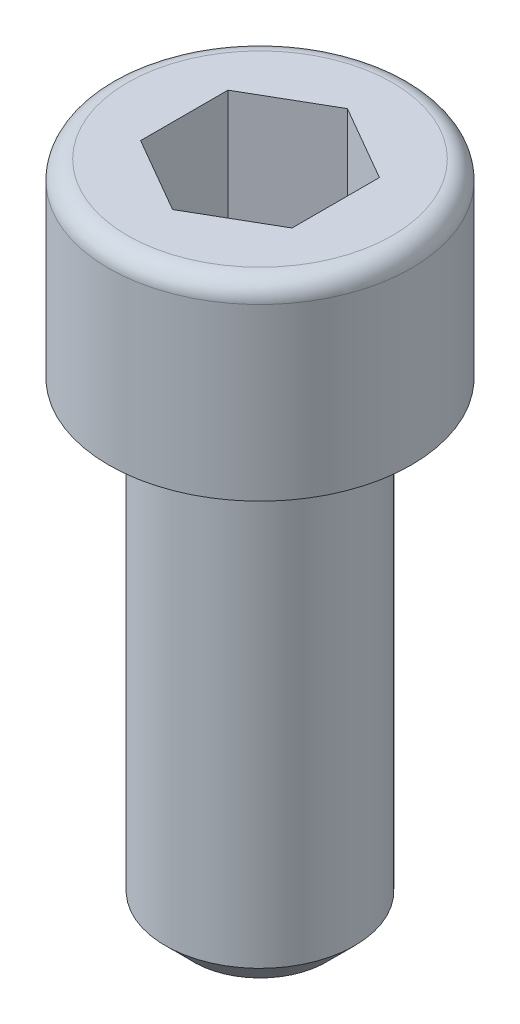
ISO-10303-21;
HEADER;
FILE_DESCRIPTION(('STEP AP214'),'2;1');
FILE_NAME('part.step','',(''),(''),'','','');
FILE_SCHEMA(('AUTOMOTIVE_DESIGN { 1 0 10303 214 1 1 1 1 }'));
ENDSEC;
DATA;
#1=APPLICATION_CONTEXT('core data for automotive mechanical design processes');
#2=APPLICATION_PROTOCOL_DEFINITION('international standard','automotive_design',2000,#1);
#3=PRODUCT_CONTEXT('',#1,'mechanical');
#4=PRODUCT('Part','Part','',(#3));
#5=PRODUCT_RELATED_PRODUCT_CATEGORY('part','',(#4));
#6=PRODUCT_DEFINITION_FORMATION('','',#4);
#7=PRODUCT_DEFINITION_CONTEXT('part definition',#1,'design');
#8=PRODUCT_DEFINITION('design','',#6,#7);
#9=PRODUCT_DEFINITION_SHAPE('','',#8);
#10=(LENGTH_UNIT() NAMED_UNIT(*) SI_UNIT(.MILLI.,.METRE.));
#11=(NAMED_UNIT(*) PLANE_ANGLE_UNIT() SI_UNIT($,.RADIAN.));
#12=(NAMED_UNIT(*) SI_UNIT($,.STERADIAN.) SOLID_ANGLE_UNIT());
#13=UNCERTAINTY_MEASURE_WITH_UNIT(LENGTH_MEASURE(1.E-05),#10,'distance_accuracy_value','');
#14=(GEOMETRIC_REPRESENTATION_CONTEXT(3) GLOBAL_UNCERTAINTY_ASSIGNED_CONTEXT((#13)) GLOBAL_UNIT_ASSIGNED_CONTEXT((#10,
#11,#12)) REPRESENTATION_CONTEXT('',''));
#15=CARTESIAN_POINT('',(0.,0.,0.));
#16=DIRECTION('',(0.,0.,1.));
#17=DIRECTION('',(1.,0.,0.));
#18=AXIS2_PLACEMENT_3D('',#15,#16,#17);
#19=CARTESIAN_POINT('',(3.50000000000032,-35.,-1.2490009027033E-13));
#20=DIRECTION('',(0.,-1.,0.));
#21=DIRECTION('',(1.00000000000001,0.,0.));
#22=AXIS2_PLACEMENT_3D('',#19,#20,#21);
#23=PLANE('',#22);
#24=CARTESIAN_POINT('',(0.,-35.0000000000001,0.));
#25=DIRECTION('',(0.,1.,0.));
#26=DIRECTION('',(-1.00000000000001,0.,0.));
#27=AXIS2_PLACEMENT_3D('',#24,#25,#26);
#28=CIRCLE('',#27,3.5);
#29=CARTESIAN_POINT('',(-3.49999999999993,-35.0000000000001,0.));
#30=VERTEX_POINT('',#29);
#31=EDGE_CURVE('E13',#30,#30,#28,.T.);
#32=ORIENTED_EDGE('',*,*,#31,.F.);
#33=EDGE_LOOP('',(#32));
#34=FACE_BOUND('',#33,.T.);
#35=ADVANCED_FACE('F356',(#34),#23,.T.);
#36=CARTESIAN_POINT('',(0.,-35.0000000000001,0.));
#37=DIRECTION('',(0.,1.,0.));
#38=DIRECTION('',(-1.00000000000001,0.,0.));
#39=AXIS2_PLACEMENT_3D('',#36,#37,#38);
#40=CONICAL_SURFACE('',#39,3.5,0.785398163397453);
#41=CARTESIAN_POINT('',(0.,-33.5000000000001,0.));
#42=DIRECTION('',(0.,1.,0.));
#43=DIRECTION('',(-1.00000000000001,0.,0.));
#44=AXIS2_PLACEMENT_3D('',#41,#42,#43);
#45=CIRCLE('',#44,5.);
#46=CARTESIAN_POINT('',(-5.00000000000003,-33.5000000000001,0.));
#47=VERTEX_POINT('',#46);
#48=EDGE_CURVE('E363',#47,#47,#45,.T.);
#49=ORIENTED_EDGE('',*,*,#48,.F.);
#50=EDGE_LOOP('',(#49));
#51=FACE_BOUND('',#50,.T.);
#52=ORIENTED_EDGE('',*,*,#31,.T.);
#53=EDGE_LOOP('',(#52));
#54=FACE_BOUND('',#53,.T.);
#55=ADVANCED_FACE('F479',(#51,#54),#40,.T.);
#56=CARTESIAN_POINT('',(8.67361737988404E-13,65.1172922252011,0.));
#57=DIRECTION('',(0.,1.,0.));
#58=DIRECTION('',(-1.00000000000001,0.,0.));
#59=AXIS2_PLACEMENT_3D('',#56,#57,#58);
#60=CYLINDRICAL_SURFACE('',#59,5.);
#61=ORIENTED_EDGE('',*,*,#48,.T.);
#62=EDGE_LOOP('',(#61));
#63=FACE_BOUND('',#62,.T.);
#64=CARTESIAN_POINT('',(0.,-9.99999999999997,0.));
#65=DIRECTION('',(0.,1.,0.));
#66=DIRECTION('',(-1.00000000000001,0.,0.));
#67=AXIS2_PLACEMENT_3D('',#64,#65,#66);
#68=CIRCLE('',#67,5.);
#69=CARTESIAN_POINT('',(-5.00000000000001,-9.99999999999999,0.));
#70=VERTEX_POINT('',#69);
#71=EDGE_CURVE('E471',#70,#70,#68,.T.);
#72=ORIENTED_EDGE('',*,*,#71,.F.);
#73=EDGE_LOOP('',(#72));
#74=FACE_BOUND('',#73,.T.);
#75=ADVANCED_FACE('F476',(#63,#74),#60,.T.);
#76=CARTESIAN_POINT('',(5.00000000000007,-9.9999999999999,0.));
#77=DIRECTION('',(0.,1.,0.));
#78=DIRECTION('',(-1.00000000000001,0.,0.));
#79=AXIS2_PLACEMENT_3D('',#76,#77,#78);
#80=PLANE('',#79);
#81=CARTESIAN_POINT('',(0.,-9.99999999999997,0.));
#82=DIRECTION('',(0.,1.,0.));
#83=DIRECTION('',(-1.00000000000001,0.,0.));
#84=AXIS2_PLACEMENT_3D('',#81,#82,#83);
#85=CIRCLE('',#84,8.);
#86=CARTESIAN_POINT('',(-8.00000000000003,-10.,0.));
#87=VERTEX_POINT('',#86);
#88=EDGE_CURVE('E468',#87,#87,#85,.T.);
#89=ORIENTED_EDGE('',*,*,#88,.F.);
#90=EDGE_LOOP('',(#89));
#91=FACE_BOUND('',#90,.T.);
#92=ORIENTED_EDGE('',*,*,#71,.T.);
#93=EDGE_LOOP('',(#92));
#94=FACE_BOUND('',#93,.T.);
#95=ADVANCED_FACE('F493',(#91,#94),#80,.F.);
#96=CARTESIAN_POINT('',(8.67361737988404E-13,65.1172922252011,0.));
#97=DIRECTION('',(0.,1.,0.));
#98=DIRECTION('',(-1.00000000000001,0.,0.));
#99=AXIS2_PLACEMENT_3D('',#96,#97,#98);
#100=CYLINDRICAL_SURFACE('',#99,8.);
#101=CARTESIAN_POINT('',(6.17561557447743E-13,-1.,3.05311331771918E-13));
#102=DIRECTION('',(0.,1.,0.));
#103=DIRECTION('',(-1.00000000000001,0.,0.));
#104=AXIS2_PLACEMENT_3D('',#101,#102,#103);
#105=CIRCLE('',#104,8.);
#106=CARTESIAN_POINT('',(-7.99999999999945,-1.00000000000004,2.35589325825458E-13));
#107=VERTEX_POINT('',#106);
#108=EDGE_CURVE('E465',#107,#107,#105,.T.);
#109=ORIENTED_EDGE('',*,*,#108,.F.);
#110=EDGE_LOOP('',(#109));
#111=FACE_BOUND('',#110,.T.);
#112=ORIENTED_EDGE('',*,*,#88,.T.);
#113=EDGE_LOOP('',(#112));
#114=FACE_BOUND('',#113,.T.);
#115=ADVANCED_FACE('F498',(#111,#114),#100,.T.);
#116=CARTESIAN_POINT('',(6.17561557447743E-13,-1.,3.05311331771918E-13));
#117=DIRECTION('',(0.,1.,0.));
#118=DIRECTION('',(-1.00000000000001,0.,0.));
#119=AXIS2_PLACEMENT_3D('',#116,#117,#118);
#120=TOROIDAL_SURFACE('',#119,7.,1.);
#121=CARTESIAN_POINT('',(1.31838984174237E-13,0.,1.2490009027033E-13));
#122=DIRECTION('',(0.,1.,0.));
#123=DIRECTION('',(-1.00000000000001,0.,0.));
#124=AXIS2_PLACEMENT_3D('',#121,#122,#123);
#125=CIRCLE('',#124,7.);
#126=CARTESIAN_POINT('',(-6.99999999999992,0.,0.));
#127=VERTEX_POINT('',#126);
#128=EDGE_CURVE('E462',#127,#127,#125,.T.);
#129=ORIENTED_EDGE('',*,*,#128,.F.);
#130=EDGE_LOOP('',(#129));
#131=FACE_BOUND('',#130,.T.);
#132=ORIENTED_EDGE('',*,*,#108,.T.);
#133=EDGE_LOOP('',(#132));
#134=FACE_BOUND('',#133,.T.);
#135=ADVANCED_FACE('F504',(#131,#134),#120,.T.);
#136=CARTESIAN_POINT('',(7.00000000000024,0.,0.));
#137=DIRECTION('',(0.,-1.,0.));
#138=DIRECTION('',(1.00000000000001,0.,0.));
#139=AXIS2_PLACEMENT_3D('',#136,#137,#138);
#140=PLANE('',#139);
#141=DIRECTION('',(0.,0.,1.));
#142=VECTOR('',#141,1.);
#143=CARTESIAN_POINT('',(-4.00000000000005,0.,-2.30940107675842));
#144=LINE('',#143,#142);
#145=CARTESIAN_POINT('',(-4.00000000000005,0.,-2.30940107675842));
#146=VERTEX_POINT('',#145);
#147=CARTESIAN_POINT('',(-3.99999999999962,0.,2.30940107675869));
#148=VERTEX_POINT('',#147);
#149=EDGE_CURVE('E433',#146,#148,#144,.T.);
#150=ORIENTED_EDGE('',*,*,#149,.F.);
#151=DIRECTION('',(-0.866025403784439,0.,0.5));
#152=VECTOR('',#151,1.);
#153=CARTESIAN_POINT('',(2.35922392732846E-13,0.,-4.61880215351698));
#154=LINE('',#153,#152);
#155=CARTESIAN_POINT('',(2.35922392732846E-13,0.,-4.61880215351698));
#156=VERTEX_POINT('',#155);
#157=EDGE_CURVE('E370',#156,#146,#154,.T.);
#158=ORIENTED_EDGE('',*,*,#157,.F.);
#159=DIRECTION('',(0.866025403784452,0.,0.500000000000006));
#160=VECTOR('',#159,1.);
#161=CARTESIAN_POINT('',(2.35922392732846E-13,0.,-4.61880215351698));
#162=LINE('',#161,#160);
#163=CARTESIAN_POINT('',(4.00000000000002,0.,-2.30940107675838));
#164=VERTEX_POINT('',#163);
#165=EDGE_CURVE('E605',#156,#164,#162,.T.);
#166=ORIENTED_EDGE('',*,*,#165,.T.);
#167=DIRECTION('',(0.,0.,1.));
#168=VECTOR('',#167,1.);
#169=CARTESIAN_POINT('',(4.00000000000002,0.,-2.30940107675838));
#170=LINE('',#169,#168);
#171=CARTESIAN_POINT('',(4.00000000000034,0.,2.3094010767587));
#172=VERTEX_POINT('',#171);
#173=EDGE_CURVE('E602',#164,#172,#170,.T.);
#174=ORIENTED_EDGE('',*,*,#173,.T.);
#175=DIRECTION('',(-0.866025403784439,0.,0.5));
#176=VECTOR('',#175,1.);
#177=CARTESIAN_POINT('',(4.00000000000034,0.,2.3094010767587));
#178=LINE('',#177,#176);
#179=CARTESIAN_POINT('',(0.,0.,4.61880215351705));
#180=VERTEX_POINT('',#179);
#181=EDGE_CURVE('E599',#172,#180,#178,.T.);
#182=ORIENTED_EDGE('',*,*,#181,.T.);
#183=DIRECTION('',(0.866025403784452,0.,0.500000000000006));
#184=VECTOR('',#183,1.);
#185=CARTESIAN_POINT('',(-3.99999999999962,0.,2.30940107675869));
#186=LINE('',#185,#184);
#187=EDGE_CURVE('E597',#148,#180,#186,.T.);
#188=ORIENTED_EDGE('',*,*,#187,.F.);
#189=EDGE_LOOP('',(#150,#158,#166,#174,#182,#188));
#190=FACE_BOUND('',#189,.T.);
#191=ORIENTED_EDGE('',*,*,#128,.T.);
#192=EDGE_LOOP('',(#191));
#193=FACE_BOUND('',#192,.T.);
#194=ADVANCED_FACE('F510',(#190,#193),#140,.F.);
#195=CARTESIAN_POINT('',(2.42861286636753E-13,-7.19999999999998,-4.61880215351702));
#196=DIRECTION('',(-0.500000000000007,0.,-0.86602540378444));
#197=DIRECTION('',(-0.866025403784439,0.,0.5));
#198=AXIS2_PLACEMENT_3D('',#195,#196,#197);
#199=PLANE('',#198);
#200=DIRECTION('',(0.,1.,0.));
#201=VECTOR('',#200,1.);
#202=CARTESIAN_POINT('',(2.42861286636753E-13,-7.19999999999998,-4.61880215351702));
#203=LINE('',#202,#201);
#204=CARTESIAN_POINT('',(2.42861286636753E-13,-7.19999999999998,-4.61880215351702));
#205=VERTEX_POINT('',#204);
#206=EDGE_CURVE('E460',#205,#156,#203,.T.);
#207=ORIENTED_EDGE('',*,*,#206,.T.);
#208=ORIENTED_EDGE('',*,*,#157,.T.);
#209=DIRECTION('',(0.,1.,0.));
#210=VECTOR('',#209,1.);
#211=CARTESIAN_POINT('',(-4.00000000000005,-7.20000000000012,-2.30940107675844));
#212=LINE('',#211,#210);
#213=CARTESIAN_POINT('',(-4.00000000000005,-7.20000000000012,-2.30940107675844));
#214=VERTEX_POINT('',#213);
#215=EDGE_CURVE('E438',#214,#146,#212,.T.);
#216=ORIENTED_EDGE('',*,*,#215,.F.);
#217=DIRECTION('',(-0.866025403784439,0.,0.5));
#218=VECTOR('',#217,1.);
#219=CARTESIAN_POINT('',(2.42861286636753E-13,-7.19999999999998,-4.61880215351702));
#220=LINE('',#219,#218);
#221=EDGE_CURVE('E427',#205,#214,#220,.T.);
#222=ORIENTED_EDGE('',*,*,#221,.F.);
#223=EDGE_LOOP('',(#207,#208,#216,#222));
#224=FACE_BOUND('',#223,.T.);
#225=ADVANCED_FACE('F516',(#224),#199,.F.);
#226=CARTESIAN_POINT('',(2.42861286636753E-13,-7.19999999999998,-4.61880215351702));
#227=DIRECTION('',(-0.500000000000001,0.,0.866025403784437));
#228=DIRECTION('',(0.866025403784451,0.,0.500000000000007));
#229=AXIS2_PLACEMENT_3D('',#226,#227,#228);
#230=PLANE('',#229);
#231=DIRECTION('',(0.,1.,0.));
#232=VECTOR('',#231,1.);
#233=CARTESIAN_POINT('',(4.,-7.1999999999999,-2.30940107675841));
#234=LINE('',#233,#232);
#235=CARTESIAN_POINT('',(4.,-7.1999999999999,-2.30940107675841));
#236=VERTEX_POINT('',#235);
#237=EDGE_CURVE('E458',#236,#164,#234,.T.);
#238=ORIENTED_EDGE('',*,*,#237,.T.);
#239=ORIENTED_EDGE('',*,*,#165,.F.);
#240=ORIENTED_EDGE('',*,*,#206,.F.);
#241=DIRECTION('',(0.866025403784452,0.,0.500000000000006));
#242=VECTOR('',#241,1.);
#243=CARTESIAN_POINT('',(2.42861286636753E-13,-7.19999999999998,-4.61880215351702));
#244=LINE('',#243,#242);
#245=EDGE_CURVE('E451',#205,#236,#244,.T.);
#246=ORIENTED_EDGE('',*,*,#245,.T.);
#247=EDGE_LOOP('',(#238,#239,#240,#246));
#248=FACE_BOUND('',#247,.T.);
#249=ADVANCED_FACE('F522',(#248),#230,.T.);
#250=CARTESIAN_POINT('',(4.,-7.1999999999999,-2.30940107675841));
#251=DIRECTION('',(-1.00000000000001,0.,0.));
#252=DIRECTION('',(0.,-1.,0.));
#253=AXIS2_PLACEMENT_3D('',#250,#251,#252);
#254=PLANE('',#253);
#255=DIRECTION('',(0.,1.,0.));
#256=VECTOR('',#255,1.);
#257=CARTESIAN_POINT('',(4.00000000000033,-7.19999999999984,2.30940107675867));
#258=LINE('',#257,#256);
#259=CARTESIAN_POINT('',(4.00000000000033,-7.19999999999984,2.30940107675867));
#260=VERTEX_POINT('',#259);
#261=EDGE_CURVE('E456',#260,#172,#258,.T.);
#262=ORIENTED_EDGE('',*,*,#261,.T.);
#263=ORIENTED_EDGE('',*,*,#173,.F.);
#264=ORIENTED_EDGE('',*,*,#237,.F.);
#265=DIRECTION('',(0.,0.,1.));
#266=VECTOR('',#265,1.);
#267=CARTESIAN_POINT('',(4.,-7.1999999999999,-2.30940107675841));
#268=LINE('',#267,#266);
#269=EDGE_CURVE('E445',#236,#260,#268,.T.);
#270=ORIENTED_EDGE('',*,*,#269,.T.);
#271=EDGE_LOOP('',(#262,#263,#264,#270));
#272=FACE_BOUND('',#271,.T.);
#273=ADVANCED_FACE('F527',(#272),#254,.T.);
#274=CARTESIAN_POINT('',(4.00000000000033,-7.19999999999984,2.30940107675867));
#275=DIRECTION('',(-0.500000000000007,0.,-0.86602540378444));
#276=DIRECTION('',(-0.866025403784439,0.,0.5));
#277=AXIS2_PLACEMENT_3D('',#274,#275,#276);
#278=PLANE('',#277);
#279=DIRECTION('',(0.,1.,0.));
#280=VECTOR('',#279,1.);
#281=CARTESIAN_POINT('',(0.,-7.19999999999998,4.61880215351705));
#282=LINE('',#281,#280);
#283=CARTESIAN_POINT('',(0.,-7.19999999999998,4.61880215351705));
#284=VERTEX_POINT('',#283);
#285=EDGE_CURVE('E437',#284,#180,#282,.T.);
#286=ORIENTED_EDGE('',*,*,#285,.T.);
#287=ORIENTED_EDGE('',*,*,#181,.F.);
#288=ORIENTED_EDGE('',*,*,#261,.F.);
#289=DIRECTION('',(-0.866025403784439,0.,0.5));
#290=VECTOR('',#289,1.);
#291=CARTESIAN_POINT('',(4.00000000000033,-7.19999999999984,2.30940107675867));
#292=LINE('',#291,#290);
#293=EDGE_CURVE('E443',#260,#284,#292,.T.);
#294=ORIENTED_EDGE('',*,*,#293,.T.);
#295=EDGE_LOOP('',(#286,#287,#288,#294));
#296=FACE_BOUND('',#295,.T.);
#297=ADVANCED_FACE('F533',(#296),#278,.T.);
#298=CARTESIAN_POINT('',(-3.99999999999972,-7.20000000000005,2.30940107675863));
#299=DIRECTION('',(-0.5,0.,0.866025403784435));
#300=DIRECTION('',(0.866025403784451,0.,0.500000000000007));
#301=AXIS2_PLACEMENT_3D('',#298,#299,#300);
#302=PLANE('',#301);
#303=DIRECTION('',(0.,1.,0.));
#304=VECTOR('',#303,1.);
#305=CARTESIAN_POINT('',(-3.99999999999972,-7.20000000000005,2.30940107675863));
#306=LINE('',#305,#304);
#307=CARTESIAN_POINT('',(-3.99999999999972,-7.20000000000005,2.30940107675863));
#308=VERTEX_POINT('',#307);
#309=EDGE_CURVE('E430',#308,#148,#306,.T.);
#310=ORIENTED_EDGE('',*,*,#309,.T.);
#311=ORIENTED_EDGE('',*,*,#187,.T.);
#312=ORIENTED_EDGE('',*,*,#285,.F.);
#313=DIRECTION('',(0.866025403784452,0.,0.500000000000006));
#314=VECTOR('',#313,1.);
#315=CARTESIAN_POINT('',(-3.99999999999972,-7.20000000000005,2.30940107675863));
#316=LINE('',#315,#314);
#317=EDGE_CURVE('E378',#308,#284,#316,.T.);
#318=ORIENTED_EDGE('',*,*,#317,.F.);
#319=EDGE_LOOP('',(#310,#311,#312,#318));
#320=FACE_BOUND('',#319,.T.);
#321=ADVANCED_FACE('F441',(#320),#302,.F.);
#322=CARTESIAN_POINT('',(-4.00000000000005,-7.20000000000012,-2.30940107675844));
#323=DIRECTION('',(-1.00000000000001,0.,0.));
#324=DIRECTION('',(0.,-1.,0.));
#325=AXIS2_PLACEMENT_3D('',#322,#323,#324);
#326=PLANE('',#325);
#327=DIRECTION('',(0.,0.,1.));
#328=VECTOR('',#327,1.);
#329=CARTESIAN_POINT('',(-4.00000000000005,-7.20000000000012,-2.30940107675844));
#330=LINE('',#329,#328);
#331=EDGE_CURVE('E420',#214,#308,#330,.T.);
#332=ORIENTED_EDGE('',*,*,#331,.F.);
#333=ORIENTED_EDGE('',*,*,#215,.T.);
#334=ORIENTED_EDGE('',*,*,#149,.T.);
#335=ORIENTED_EDGE('',*,*,#309,.F.);
#336=EDGE_LOOP('',(#332,#333,#334,#335));
#337=FACE_BOUND('',#336,.T.);
#338=ADVANCED_FACE('F431',(#337),#326,.F.);
#339=CARTESIAN_POINT('',(-4.00000000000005,-7.20000000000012,-2.30940107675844));
#340=DIRECTION('',(0.098058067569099,0.980580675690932,0.169841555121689));
#341=DIRECTION('',(0.,-0.170664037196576,0.985329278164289));
#342=AXIS2_PLACEMENT_3D('',#339,#340,#341);
#343=PLANE('',#342);
#344=DIRECTION('',(-0.853320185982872,0.170664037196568,-0.492664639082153));
#345=VECTOR('',#344,1.);
#346=CARTESIAN_POINT('',(6.24500451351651E-13,-7.99999999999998,3.05311331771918E-13));
#347=LINE('',#346,#345);
#348=CARTESIAN_POINT('',(6.24500451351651E-13,-7.99999999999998,3.05311331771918E-13));
#349=VERTEX_POINT('',#348);
#350=EDGE_CURVE('E424',#349,#214,#347,.T.);
#351=ORIENTED_EDGE('',*,*,#350,.F.);
#352=DIRECTION('',(0.,0.170664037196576,-0.985329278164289));
#353=VECTOR('',#352,1.);
#354=CARTESIAN_POINT('',(6.24500451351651E-13,-7.99999999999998,3.05311331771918E-13));
#355=LINE('',#354,#353);
#356=EDGE_CURVE('E585',#349,#205,#355,.T.);
#357=ORIENTED_EDGE('',*,*,#356,.T.);
#358=ORIENTED_EDGE('',*,*,#221,.T.);
#359=EDGE_LOOP('',(#351,#357,#358));
#360=FACE_BOUND('',#359,.T.);
#361=ADVANCED_FACE('F548',(#360),#343,.T.);
#362=CARTESIAN_POINT('',(2.42861286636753E-13,-7.19999999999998,-4.61880215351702));
#363=DIRECTION('',(-0.0980580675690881,0.98058067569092,0.169841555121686));
#364=DIRECTION('',(0.,-0.170664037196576,0.985329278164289));
#365=AXIS2_PLACEMENT_3D('',#362,#363,#364);
#366=PLANE('',#365);
#367=ORIENTED_EDGE('',*,*,#356,.F.);
#368=DIRECTION('',(0.853320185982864,0.170664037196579,-0.492664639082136));
#369=VECTOR('',#368,1.);
#370=CARTESIAN_POINT('',(6.24500451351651E-13,-7.99999999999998,3.05311331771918E-13));
#371=LINE('',#370,#369);
#372=EDGE_CURVE('E416',#349,#236,#371,.T.);
#373=ORIENTED_EDGE('',*,*,#372,.T.);
#374=ORIENTED_EDGE('',*,*,#245,.F.);
#375=EDGE_LOOP('',(#367,#373,#374));
#376=FACE_BOUND('',#375,.T.);
#377=ADVANCED_FACE('F554',(#376),#366,.T.);
#378=CARTESIAN_POINT('',(-3.99999999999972,-7.20000000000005,2.30940107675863));
#379=DIRECTION('',(0.196116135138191,0.98058067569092,0.));
#380=DIRECTION('',(-0.98058067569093,0.19611613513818,0.));
#381=AXIS2_PLACEMENT_3D('',#378,#379,#380);
#382=PLANE('',#381);
#383=DIRECTION('',(-0.853320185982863,0.170664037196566,0.492664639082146));
#384=VECTOR('',#383,1.);
#385=CARTESIAN_POINT('',(6.24500451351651E-13,-7.99999999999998,3.05311331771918E-13));
#386=LINE('',#385,#384);
#387=EDGE_CURVE('E410',#349,#308,#386,.T.);
#388=ORIENTED_EDGE('',*,*,#387,.F.);
#389=ORIENTED_EDGE('',*,*,#350,.T.);
#390=ORIENTED_EDGE('',*,*,#331,.T.);
#391=EDGE_LOOP('',(#388,#389,#390));
#392=FACE_BOUND('',#391,.T.);
#393=ADVANCED_FACE('F422',(#392),#382,.T.);
#394=CARTESIAN_POINT('',(4.,-7.1999999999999,-2.30940107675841));
#395=DIRECTION('',(-0.196116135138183,0.98058067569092,0.));
#396=DIRECTION('',(-0.980580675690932,-0.196116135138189,0.));
#397=AXIS2_PLACEMENT_3D('',#394,#395,#396);
#398=PLANE('',#397);
#399=ORIENTED_EDGE('',*,*,#372,.F.);
#400=DIRECTION('',(0.853320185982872,0.170664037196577,0.492664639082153));
#401=VECTOR('',#400,1.);
#402=CARTESIAN_POINT('',(6.24500451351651E-13,-7.99999999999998,3.05311331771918E-13));
#403=LINE('',#402,#401);
#404=EDGE_CURVE('E417',#349,#260,#403,.T.);
#405=ORIENTED_EDGE('',*,*,#404,.T.);
#406=ORIENTED_EDGE('',*,*,#269,.F.);
#407=EDGE_LOOP('',(#399,#405,#406));
#408=FACE_BOUND('',#407,.T.);
#409=ADVANCED_FACE('F565',(#408),#398,.T.);
#410=CARTESIAN_POINT('',(0.,-7.19999999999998,4.61880215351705));
#411=DIRECTION('',(0.0980580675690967,0.98058067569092,-0.16984155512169));
#412=DIRECTION('',(0.,0.170664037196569,0.985329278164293));
#413=AXIS2_PLACEMENT_3D('',#410,#411,#412);
#414=PLANE('',#413);
#415=DIRECTION('',(0.,0.170664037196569,0.985329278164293));
#416=VECTOR('',#415,1.);
#417=CARTESIAN_POINT('',(6.24500451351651E-13,-7.99999999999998,3.05311331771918E-13));
#418=LINE('',#417,#416);
#419=EDGE_CURVE('E413',#349,#284,#418,.T.);
#420=ORIENTED_EDGE('',*,*,#419,.F.);
#421=ORIENTED_EDGE('',*,*,#387,.T.);
#422=ORIENTED_EDGE('',*,*,#317,.T.);
#423=EDGE_LOOP('',(#420,#421,#422));
#424=FACE_BOUND('',#423,.T.);
#425=ADVANCED_FACE('F412',(#424),#414,.T.);
#426=CARTESIAN_POINT('',(4.00000000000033,-7.19999999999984,2.30940107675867));
#427=DIRECTION('',(-0.0980580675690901,0.980580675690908,-0.169841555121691));
#428=DIRECTION('',(0.,0.170664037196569,0.985329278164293));
#429=AXIS2_PLACEMENT_3D('',#426,#427,#428);
#430=PLANE('',#429);
#431=ORIENTED_EDGE('',*,*,#404,.F.);
#432=ORIENTED_EDGE('',*,*,#419,.T.);
#433=ORIENTED_EDGE('',*,*,#293,.F.);
#434=EDGE_LOOP('',(#431,#432,#433));
#435=FACE_BOUND('',#434,.T.);
#436=ADVANCED_FACE('F550',(#435),#430,.T.);
#437=CLOSED_SHELL('',(#35,#55,#75,#95,#115,#135,#194,#225,#249,#273,#297,#321,#338,#361,#377,
#393,#409,#425,#436));
#438=MANIFOLD_SOLID_BREP('B2',#437);
#439=ADVANCED_BREP_SHAPE_REPRESENTATION('',(#18,#438),#14);
#440=SHAPE_DEFINITION_REPRESENTATION(#9,#439);
ENDSEC;
END-ISO-10303-21;
